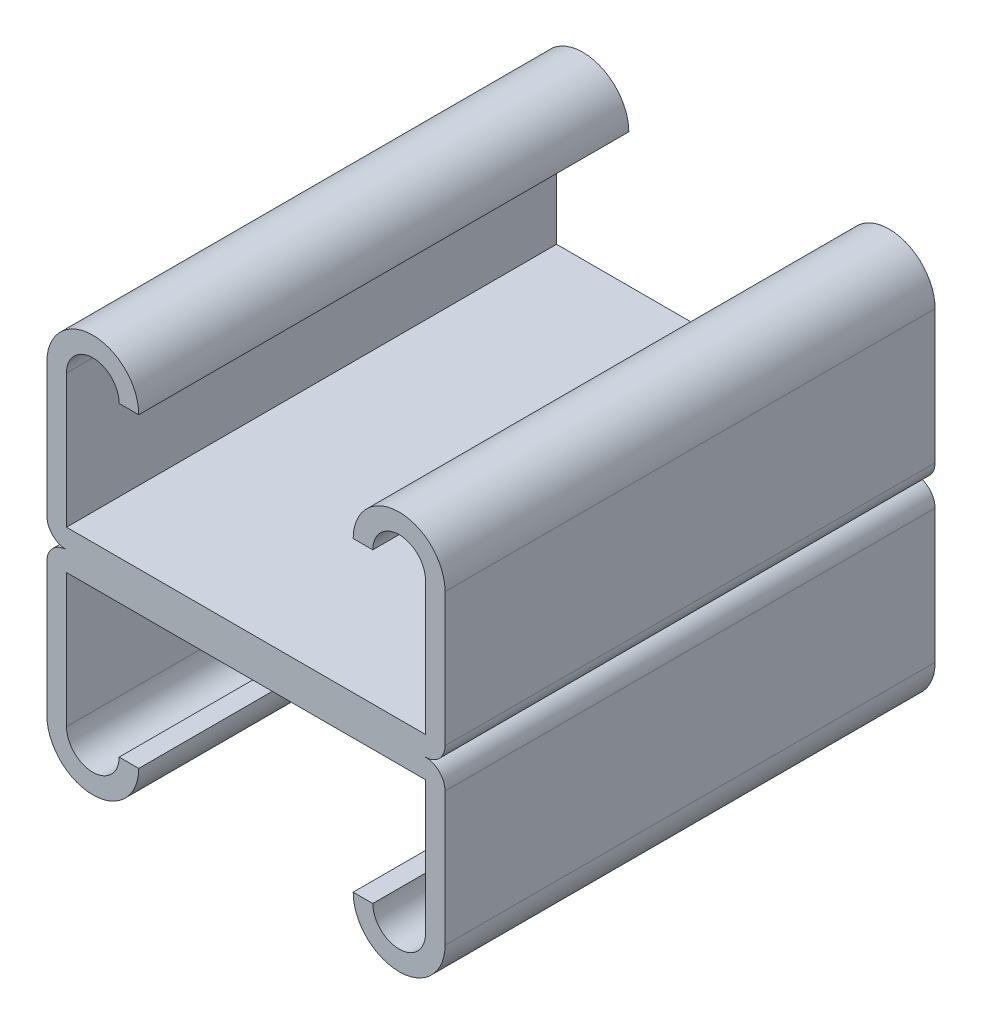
from build123d import *

# Parameters (mm, degrees)
BASE_EXTRUDE_DEPTH = 12.7


with BuildPart() as part:
    # Sketch1 → Base-Extrude (new, symmetric)
    with BuildSketch(Plane.XY):
        with BuildLine():
            Line((-10.31875, 7.9375), (-10.31875, 1.016))
            ThreePointArc((-10.31875, 1.016), (-10.02117049, 0.29757951), (-9.30275, 0))
            Line((-9.30275, 0), (9.30275, 0))
            ThreePointArc((9.30275, 0), (10.02117049, 0.29757951), (10.31875, 1.016))
            Line((10.31875, 1.016), (10.31875, 7.9375))
            ThreePointArc((10.31875, 7.9375), (7.9375, 10.31875), (5.55625, 7.9375))
            Line((5.55625, 7.9375), (6.57225, 7.9375))
            ThreePointArc((6.57225, 7.9375), (7.9375, 9.30275), (9.30275, 7.9375))
            Line((9.30275, 7.9375), (9.30275, 1.016))
            Line((9.30275, 1.016), (-9.30275, 1.016))
            Line((-9.30275, 1.016), (-9.30275, 7.9375))
            ThreePointArc((-9.30275, 7.9375), (-7.9375, 9.30275), (-6.57225, 7.9375))
            Line((-6.57225, 7.9375), (-5.55625, 7.9375))
            ThreePointArc((-5.55625, 7.9375), (-7.9375, 10.31875), (-10.31875, 7.9375))
        make_face()
    base_extrude = extrude(amount=BASE_EXTRUDE_DEPTH, both=True)

    # Mirror1: Base-Extrude across plane
    add(base_extrude.mirror(Plane.ZX))


solid = part.part
